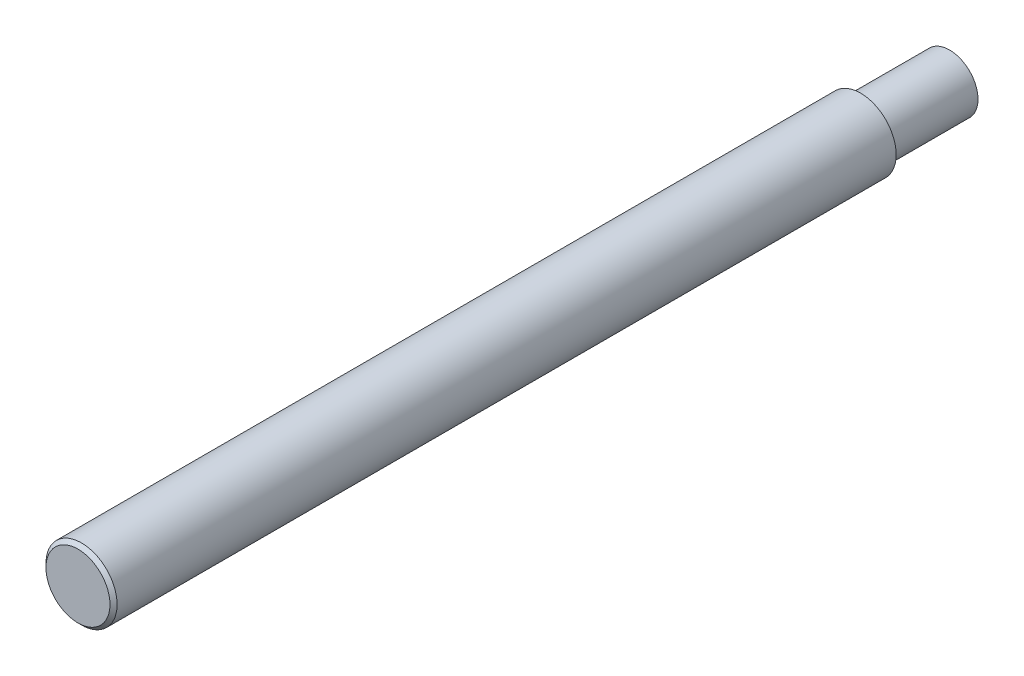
from build123d import *

# Parameters (mm, degrees)
SKETCH_1_R      = 10
EXTRUDE_1_DEPTH = 220
SKETCH_2_R      = 8
EXTRUDE_2_DEPTH = 25
CHAMFER_1_SIZE  = 1


with BuildPart() as part:
    # Sketch 1 → Extrude 1 (new body)
    with BuildSketch(Plane.XY):
        Circle(SKETCH_1_R)
    extrude(amount=EXTRUDE_1_DEPTH)

    # Sketch 2 → Extrude 2 (add)
    with BuildSketch(Plane(origin=(0, 0, 0), x_dir=(-1, 0, 0), z_dir=(0, 0, -1))):
        with Locations(Location((0, 0, 0), (0, 0, 180))):
            Circle(SKETCH_2_R)
    extrude(amount=EXTRUDE_2_DEPTH)

    # Chamfer 1
    chamfer_1_edges = [part.edges().sort_by_distance(p)[0] for p in [
        (-10, 0, 220),
    ]]
    chamfer(chamfer_1_edges, length=CHAMFER_1_SIZE)


solid = part.part
